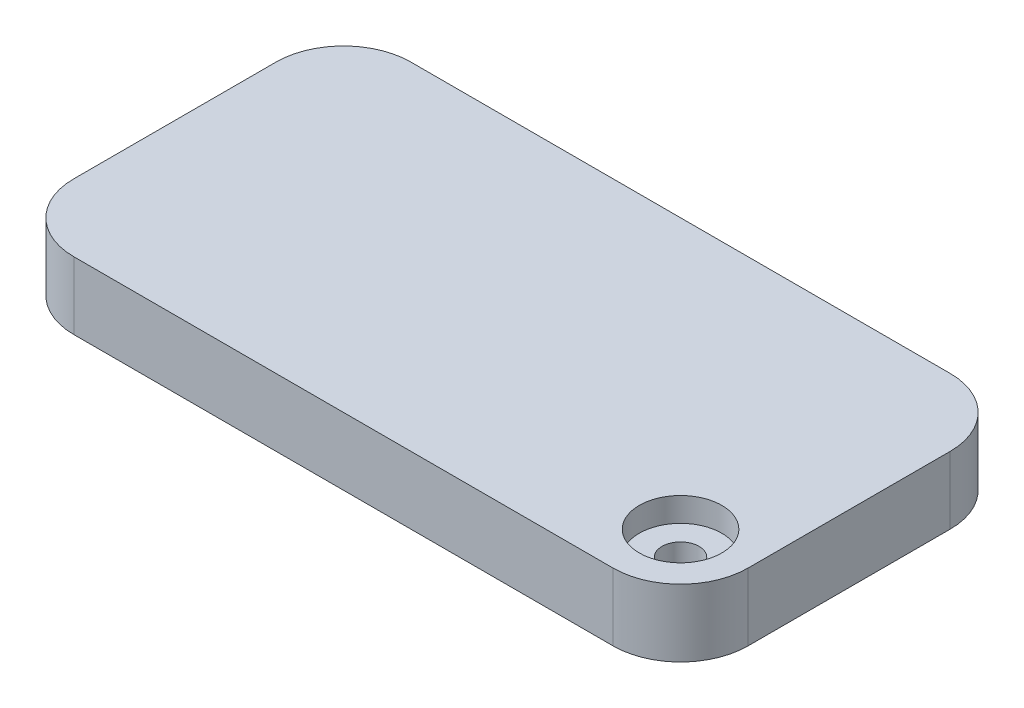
ISO-10303-21;
HEADER;
FILE_DESCRIPTION(('STEP AP214'),'2;1');
FILE_NAME('part.step','',(''),(''),'','','');
FILE_SCHEMA(('AUTOMOTIVE_DESIGN { 1 0 10303 214 1 1 1 1 }'));
ENDSEC;
DATA;
#1=APPLICATION_CONTEXT('core data for automotive mechanical design processes');
#2=APPLICATION_PROTOCOL_DEFINITION('international standard','automotive_design',2000,#1);
#3=PRODUCT_CONTEXT('',#1,'mechanical');
#4=PRODUCT('Part','Part','',(#3));
#5=PRODUCT_RELATED_PRODUCT_CATEGORY('part','',(#4));
#6=PRODUCT_DEFINITION_FORMATION('','',#4);
#7=PRODUCT_DEFINITION_CONTEXT('part definition',#1,'design');
#8=PRODUCT_DEFINITION('design','',#6,#7);
#9=PRODUCT_DEFINITION_SHAPE('','',#8);
#10=(LENGTH_UNIT() NAMED_UNIT(*) SI_UNIT(.MILLI.,.METRE.));
#11=(NAMED_UNIT(*) PLANE_ANGLE_UNIT() SI_UNIT($,.RADIAN.));
#12=(NAMED_UNIT(*) SI_UNIT($,.STERADIAN.) SOLID_ANGLE_UNIT());
#13=UNCERTAINTY_MEASURE_WITH_UNIT(LENGTH_MEASURE(1.E-05),#10,'distance_accuracy_value','');
#14=(GEOMETRIC_REPRESENTATION_CONTEXT(3) GLOBAL_UNCERTAINTY_ASSIGNED_CONTEXT((#13)) GLOBAL_UNIT_ASSIGNED_CONTEXT((#10,
#11,#12)) REPRESENTATION_CONTEXT('',''));
#15=CARTESIAN_POINT('',(0.,0.,0.));
#16=DIRECTION('',(0.,0.,1.));
#17=DIRECTION('',(1.,0.,0.));
#18=AXIS2_PLACEMENT_3D('',#15,#16,#17);
#19=CARTESIAN_POINT('',(10.,10.,-40.));
#20=DIRECTION('',(0.,-1.,0.));
#21=DIRECTION('',(0.,0.,-1.));
#22=AXIS2_PLACEMENT_3D('',#19,#20,#21);
#23=CYLINDRICAL_SURFACE('',#22,10.);
#24=CARTESIAN_POINT('',(10.,0.,-40.));
#25=DIRECTION('',(0.,1.,0.));
#26=DIRECTION('',(0.,0.,-1.));
#27=AXIS2_PLACEMENT_3D('',#24,#25,#26);
#28=CIRCLE('',#27,10.);
#29=CARTESIAN_POINT('',(10.,0.,-50.));
#30=VERTEX_POINT('',#29);
#31=CARTESIAN_POINT('',(0.,0.,-40.));
#32=VERTEX_POINT('',#31);
#33=EDGE_CURVE('E97',#30,#32,#28,.T.);
#34=ORIENTED_EDGE('',*,*,#33,.T.);
#35=DIRECTION('',(0.,-1.,0.));
#36=VECTOR('',#35,1.);
#37=CARTESIAN_POINT('',(0.,10.,-40.));
#38=LINE('',#37,#36);
#39=CARTESIAN_POINT('',(0.,10.,-40.));
#40=VERTEX_POINT('',#39);
#41=EDGE_CURVE('E11',#40,#32,#38,.T.);
#42=ORIENTED_EDGE('',*,*,#41,.F.);
#43=CARTESIAN_POINT('',(10.,10.,-40.));
#44=DIRECTION('',(0.,1.,0.));
#45=DIRECTION('',(0.,0.,-1.));
#46=AXIS2_PLACEMENT_3D('',#43,#44,#45);
#47=CIRCLE('',#46,10.);
#48=CARTESIAN_POINT('',(10.,10.,-50.));
#49=VERTEX_POINT('',#48);
#50=EDGE_CURVE('E129',#49,#40,#47,.T.);
#51=ORIENTED_EDGE('',*,*,#50,.F.);
#52=DIRECTION('',(0.,-1.,0.));
#53=VECTOR('',#52,1.);
#54=CARTESIAN_POINT('',(10.,10.,-50.));
#55=LINE('',#54,#53);
#56=EDGE_CURVE('E110',#49,#30,#55,.T.);
#57=ORIENTED_EDGE('',*,*,#56,.T.);
#58=EDGE_LOOP('',(#34,#42,#51,#57));
#59=FACE_BOUND('',#58,.T.);
#60=ADVANCED_FACE('F29',(#59),#23,.T.);
#61=CARTESIAN_POINT('',(0.,10.,-10.));
#62=DIRECTION('',(1.,0.,0.));
#63=DIRECTION('',(0.,0.,-1.));
#64=AXIS2_PLACEMENT_3D('',#61,#62,#63);
#65=PLANE('',#64);
#66=DIRECTION('',(0.,0.,1.));
#67=VECTOR('',#66,1.);
#68=CARTESIAN_POINT('',(0.,0.,-10.));
#69=LINE('',#68,#67);
#70=CARTESIAN_POINT('',(0.,0.,-10.));
#71=VERTEX_POINT('',#70);
#72=EDGE_CURVE('E93',#32,#71,#69,.T.);
#73=ORIENTED_EDGE('',*,*,#72,.T.);
#74=DIRECTION('',(0.,-1.,0.));
#75=VECTOR('',#74,1.);
#76=CARTESIAN_POINT('',(0.,10.,-10.));
#77=LINE('',#76,#75);
#78=CARTESIAN_POINT('',(0.,10.,-10.));
#79=VERTEX_POINT('',#78);
#80=EDGE_CURVE('E36',#79,#71,#77,.T.);
#81=ORIENTED_EDGE('',*,*,#80,.F.);
#82=DIRECTION('',(0.,0.,1.));
#83=VECTOR('',#82,1.);
#84=CARTESIAN_POINT('',(0.,10.,-10.));
#85=LINE('',#84,#83);
#86=EDGE_CURVE('E106',#40,#79,#85,.T.);
#87=ORIENTED_EDGE('',*,*,#86,.F.);
#88=ORIENTED_EDGE('',*,*,#41,.T.);
#89=EDGE_LOOP('',(#73,#81,#87,#88));
#90=FACE_BOUND('',#89,.T.);
#91=ADVANCED_FACE('F105',(#90),#65,.F.);
#92=CARTESIAN_POINT('',(10.,10.,-10.));
#93=DIRECTION('',(0.,-1.,0.));
#94=DIRECTION('',(0.,0.,-1.));
#95=AXIS2_PLACEMENT_3D('',#92,#93,#94);
#96=CYLINDRICAL_SURFACE('',#95,10.);
#97=CARTESIAN_POINT('',(10.,0.,-10.));
#98=DIRECTION('',(0.,1.,0.));
#99=DIRECTION('',(0.,0.,-1.));
#100=AXIS2_PLACEMENT_3D('',#97,#98,#99);
#101=CIRCLE('',#100,10.);
#102=CARTESIAN_POINT('',(10.,0.,0.));
#103=VERTEX_POINT('',#102);
#104=EDGE_CURVE('E99',#71,#103,#101,.T.);
#105=ORIENTED_EDGE('',*,*,#104,.T.);
#106=DIRECTION('',(0.,-1.,0.));
#107=VECTOR('',#106,1.);
#108=CARTESIAN_POINT('',(10.,10.,0.));
#109=LINE('',#108,#107);
#110=CARTESIAN_POINT('',(10.,10.,0.));
#111=VERTEX_POINT('',#110);
#112=EDGE_CURVE('E155',#111,#103,#109,.T.);
#113=ORIENTED_EDGE('',*,*,#112,.F.);
#114=CARTESIAN_POINT('',(10.,10.,-10.));
#115=DIRECTION('',(0.,1.,0.));
#116=DIRECTION('',(0.,0.,-1.));
#117=AXIS2_PLACEMENT_3D('',#114,#115,#116);
#118=CIRCLE('',#117,10.);
#119=EDGE_CURVE('E132',#79,#111,#118,.T.);
#120=ORIENTED_EDGE('',*,*,#119,.F.);
#121=ORIENTED_EDGE('',*,*,#80,.T.);
#122=EDGE_LOOP('',(#105,#113,#120,#121));
#123=FACE_BOUND('',#122,.T.);
#124=ADVANCED_FACE('F159',(#123),#96,.T.);
#125=CARTESIAN_POINT('',(10.,10.,0.));
#126=DIRECTION('',(0.,0.,-1.));
#127=DIRECTION('',(-1.,0.,0.));
#128=AXIS2_PLACEMENT_3D('',#125,#126,#127);
#129=PLANE('',#128);
#130=DIRECTION('',(1.,0.,0.));
#131=VECTOR('',#130,1.);
#132=CARTESIAN_POINT('',(10.,0.,0.));
#133=LINE('',#132,#131);
#134=CARTESIAN_POINT('',(90.,0.,0.));
#135=VERTEX_POINT('',#134);
#136=EDGE_CURVE('E119',#103,#135,#133,.T.);
#137=ORIENTED_EDGE('',*,*,#136,.T.);
#138=DIRECTION('',(0.,-1.,0.));
#139=VECTOR('',#138,1.);
#140=CARTESIAN_POINT('',(90.,10.,0.));
#141=LINE('',#140,#139);
#142=CARTESIAN_POINT('',(90.,10.,0.));
#143=VERTEX_POINT('',#142);
#144=EDGE_CURVE('E152',#143,#135,#141,.T.);
#145=ORIENTED_EDGE('',*,*,#144,.F.);
#146=DIRECTION('',(1.,0.,0.));
#147=VECTOR('',#146,1.);
#148=CARTESIAN_POINT('',(10.,10.,0.));
#149=LINE('',#148,#147);
#150=EDGE_CURVE('E134',#111,#143,#149,.T.);
#151=ORIENTED_EDGE('',*,*,#150,.F.);
#152=ORIENTED_EDGE('',*,*,#112,.T.);
#153=EDGE_LOOP('',(#137,#145,#151,#152));
#154=FACE_BOUND('',#153,.T.);
#155=ADVANCED_FACE('F167',(#154),#129,.F.);
#156=CARTESIAN_POINT('',(90.,10.,-10.));
#157=DIRECTION('',(0.,-1.,0.));
#158=DIRECTION('',(0.,0.,-1.));
#159=AXIS2_PLACEMENT_3D('',#156,#157,#158);
#160=CYLINDRICAL_SURFACE('',#159,10.);
#161=CARTESIAN_POINT('',(90.,0.,-10.));
#162=DIRECTION('',(0.,1.,0.));
#163=DIRECTION('',(0.,0.,1.));
#164=AXIS2_PLACEMENT_3D('',#161,#162,#163);
#165=CIRCLE('',#164,10.);
#166=CARTESIAN_POINT('',(100.,0.,-10.));
#167=VERTEX_POINT('',#166);
#168=EDGE_CURVE('E121',#135,#167,#165,.T.);
#169=ORIENTED_EDGE('',*,*,#168,.T.);
#170=DIRECTION('',(0.,-1.,0.));
#171=VECTOR('',#170,1.);
#172=CARTESIAN_POINT('',(100.,10.,-10.));
#173=LINE('',#172,#171);
#174=CARTESIAN_POINT('',(100.,10.,-10.));
#175=VERTEX_POINT('',#174);
#176=EDGE_CURVE('E149',#175,#167,#173,.T.);
#177=ORIENTED_EDGE('',*,*,#176,.F.);
#178=CARTESIAN_POINT('',(90.,10.,-10.));
#179=DIRECTION('',(0.,1.,0.));
#180=DIRECTION('',(0.,0.,1.));
#181=AXIS2_PLACEMENT_3D('',#178,#179,#180);
#182=CIRCLE('',#181,10.);
#183=EDGE_CURVE('E136',#143,#175,#182,.T.);
#184=ORIENTED_EDGE('',*,*,#183,.F.);
#185=ORIENTED_EDGE('',*,*,#144,.T.);
#186=EDGE_LOOP('',(#169,#177,#184,#185));
#187=FACE_BOUND('',#186,.T.);
#188=ADVANCED_FACE('F170',(#187),#160,.T.);
#189=CARTESIAN_POINT('',(100.,10.,-10.));
#190=DIRECTION('',(-1.,0.,0.));
#191=DIRECTION('',(0.,0.,1.));
#192=AXIS2_PLACEMENT_3D('',#189,#190,#191);
#193=PLANE('',#192);
#194=DIRECTION('',(0.,0.,-1.));
#195=VECTOR('',#194,1.);
#196=CARTESIAN_POINT('',(100.,0.,-10.));
#197=LINE('',#196,#195);
#198=CARTESIAN_POINT('',(100.,0.,-40.));
#199=VERTEX_POINT('',#198);
#200=EDGE_CURVE('E123',#167,#199,#197,.T.);
#201=ORIENTED_EDGE('',*,*,#200,.T.);
#202=DIRECTION('',(0.,-1.,0.));
#203=VECTOR('',#202,1.);
#204=CARTESIAN_POINT('',(100.,10.,-40.));
#205=LINE('',#204,#203);
#206=CARTESIAN_POINT('',(100.,10.,-40.));
#207=VERTEX_POINT('',#206);
#208=EDGE_CURVE('E146',#207,#199,#205,.T.);
#209=ORIENTED_EDGE('',*,*,#208,.F.);
#210=DIRECTION('',(0.,0.,-1.));
#211=VECTOR('',#210,1.);
#212=CARTESIAN_POINT('',(100.,10.,-10.));
#213=LINE('',#212,#211);
#214=EDGE_CURVE('E138',#175,#207,#213,.T.);
#215=ORIENTED_EDGE('',*,*,#214,.F.);
#216=ORIENTED_EDGE('',*,*,#176,.T.);
#217=EDGE_LOOP('',(#201,#209,#215,#216));
#218=FACE_BOUND('',#217,.T.);
#219=ADVANCED_FACE('F175',(#218),#193,.F.);
#220=CARTESIAN_POINT('',(90.,10.,-40.));
#221=DIRECTION('',(0.,-1.,0.));
#222=DIRECTION('',(0.,0.,-1.));
#223=AXIS2_PLACEMENT_3D('',#220,#221,#222);
#224=CYLINDRICAL_SURFACE('',#223,10.);
#225=CARTESIAN_POINT('',(90.,0.,-40.));
#226=DIRECTION('',(0.,1.,0.));
#227=DIRECTION('',(0.,0.,-1.));
#228=AXIS2_PLACEMENT_3D('',#225,#226,#227);
#229=CIRCLE('',#228,10.);
#230=CARTESIAN_POINT('',(90.,0.,-50.));
#231=VERTEX_POINT('',#230);
#232=EDGE_CURVE('E125',#199,#231,#229,.T.);
#233=ORIENTED_EDGE('',*,*,#232,.T.);
#234=DIRECTION('',(0.,-1.,0.));
#235=VECTOR('',#234,1.);
#236=CARTESIAN_POINT('',(90.,10.,-50.));
#237=LINE('',#236,#235);
#238=CARTESIAN_POINT('',(90.,10.,-50.));
#239=VERTEX_POINT('',#238);
#240=EDGE_CURVE('E143',#239,#231,#237,.T.);
#241=ORIENTED_EDGE('',*,*,#240,.F.);
#242=CARTESIAN_POINT('',(90.,10.,-40.));
#243=DIRECTION('',(0.,1.,0.));
#244=DIRECTION('',(0.,0.,-1.));
#245=AXIS2_PLACEMENT_3D('',#242,#243,#244);
#246=CIRCLE('',#245,10.);
#247=EDGE_CURVE('E48',#207,#239,#246,.T.);
#248=ORIENTED_EDGE('',*,*,#247,.F.);
#249=ORIENTED_EDGE('',*,*,#208,.T.);
#250=EDGE_LOOP('',(#233,#241,#248,#249));
#251=FACE_BOUND('',#250,.T.);
#252=ADVANCED_FACE('F178',(#251),#224,.T.);
#253=CARTESIAN_POINT('',(10.,10.,-50.));
#254=DIRECTION('',(0.,0.,1.));
#255=DIRECTION('',(1.,0.,0.));
#256=AXIS2_PLACEMENT_3D('',#253,#254,#255);
#257=PLANE('',#256);
#258=DIRECTION('',(-1.,0.,0.));
#259=VECTOR('',#258,1.);
#260=CARTESIAN_POINT('',(10.,0.,-50.));
#261=LINE('',#260,#259);
#262=EDGE_CURVE('E127',#231,#30,#261,.T.);
#263=ORIENTED_EDGE('',*,*,#262,.T.);
#264=ORIENTED_EDGE('',*,*,#56,.F.);
#265=DIRECTION('',(-1.,0.,0.));
#266=VECTOR('',#265,1.);
#267=CARTESIAN_POINT('',(10.,10.,-50.));
#268=LINE('',#267,#266);
#269=EDGE_CURVE('E43',#239,#49,#268,.T.);
#270=ORIENTED_EDGE('',*,*,#269,.F.);
#271=ORIENTED_EDGE('',*,*,#240,.T.);
#272=EDGE_LOOP('',(#263,#264,#270,#271));
#273=FACE_BOUND('',#272,.T.);
#274=ADVANCED_FACE('F180',(#273),#257,.F.);
#275=CARTESIAN_POINT('',(10.,10.,-40.));
#276=DIRECTION('',(0.,-1.,0.));
#277=DIRECTION('',(0.,0.,-1.));
#278=AXIS2_PLACEMENT_3D('',#275,#276,#277);
#279=PLANE('',#278);
#280=CARTESIAN_POINT('',(90.,10.,-10.));
#281=DIRECTION('',(0.,1.,0.));
#282=DIRECTION('',(0.,0.,1.));
#283=AXIS2_PLACEMENT_3D('',#280,#281,#282);
#284=CIRCLE('',#283,6.12);
#285=CARTESIAN_POINT('',(90.,10.,-3.88));
#286=VERTEX_POINT('',#285);
#287=EDGE_CURVE('E257',#286,#286,#284,.T.);
#288=ORIENTED_EDGE('',*,*,#287,.F.);
#289=EDGE_LOOP('',(#288));
#290=FACE_BOUND('',#289,.T.);
#291=ORIENTED_EDGE('',*,*,#50,.T.);
#292=ORIENTED_EDGE('',*,*,#86,.T.);
#293=ORIENTED_EDGE('',*,*,#119,.T.);
#294=ORIENTED_EDGE('',*,*,#150,.T.);
#295=ORIENTED_EDGE('',*,*,#183,.T.);
#296=ORIENTED_EDGE('',*,*,#214,.T.);
#297=ORIENTED_EDGE('',*,*,#247,.T.);
#298=ORIENTED_EDGE('',*,*,#269,.T.);
#299=EDGE_LOOP('',(#291,#292,#293,#294,#295,#296,#297,#298));
#300=FACE_BOUND('',#299,.T.);
#301=ADVANCED_FACE('F162',(#290,#300),#279,.F.);
#302=CARTESIAN_POINT('',(10.,0.,-40.));
#303=DIRECTION('',(0.,-1.,0.));
#304=DIRECTION('',(0.,0.,-1.));
#305=AXIS2_PLACEMENT_3D('',#302,#303,#304);
#306=PLANE('',#305);
#307=CARTESIAN_POINT('',(90.,0.,-10.));
#308=DIRECTION('',(0.,1.,0.));
#309=DIRECTION('',(0.,0.,1.));
#310=AXIS2_PLACEMENT_3D('',#307,#308,#309);
#311=CIRCLE('',#310,2.75);
#312=CARTESIAN_POINT('',(90.,0.,-7.25));
#313=VERTEX_POINT('',#312);
#314=EDGE_CURVE('E111',#313,#313,#311,.T.);
#315=ORIENTED_EDGE('',*,*,#314,.T.);
#316=EDGE_LOOP('',(#315));
#317=FACE_BOUND('',#316,.T.);
#318=ORIENTED_EDGE('',*,*,#33,.F.);
#319=ORIENTED_EDGE('',*,*,#262,.F.);
#320=ORIENTED_EDGE('',*,*,#232,.F.);
#321=ORIENTED_EDGE('',*,*,#200,.F.);
#322=ORIENTED_EDGE('',*,*,#168,.F.);
#323=ORIENTED_EDGE('',*,*,#136,.F.);
#324=ORIENTED_EDGE('',*,*,#104,.F.);
#325=ORIENTED_EDGE('',*,*,#72,.F.);
#326=EDGE_LOOP('',(#318,#319,#320,#321,#322,#323,#324,#325));
#327=FACE_BOUND('',#326,.T.);
#328=ADVANCED_FACE('F94',(#317,#327),#306,.T.);
#329=CARTESIAN_POINT('',(90.,10.,-10.));
#330=DIRECTION('',(0.,1.,0.));
#331=DIRECTION('',(0.,0.,1.));
#332=AXIS2_PLACEMENT_3D('',#329,#330,#331);
#333=CYLINDRICAL_SURFACE('',#332,2.75);
#334=ORIENTED_EDGE('',*,*,#314,.F.);
#335=EDGE_LOOP('',(#334));
#336=FACE_BOUND('',#335,.T.);
#337=CARTESIAN_POINT('',(90.,6.42,-10.));
#338=DIRECTION('',(0.,1.,0.));
#339=DIRECTION('',(0.,0.,1.));
#340=AXIS2_PLACEMENT_3D('',#337,#338,#339);
#341=CIRCLE('',#340,2.75);
#342=CARTESIAN_POINT('',(90.,6.42,-7.25));
#343=VERTEX_POINT('',#342);
#344=EDGE_CURVE('E114',#343,#343,#341,.T.);
#345=ORIENTED_EDGE('',*,*,#344,.T.);
#346=EDGE_LOOP('',(#345));
#347=FACE_BOUND('',#346,.T.);
#348=ADVANCED_FACE('F225',(#336,#347),#333,.F.);
#349=CARTESIAN_POINT('',(92.75,6.42,-10.));
#350=DIRECTION('',(0.,-1.,0.));
#351=DIRECTION('',(0.,0.,-1.));
#352=AXIS2_PLACEMENT_3D('',#349,#350,#351);
#353=PLANE('',#352);
#354=ORIENTED_EDGE('',*,*,#344,.F.);
#355=EDGE_LOOP('',(#354));
#356=FACE_BOUND('',#355,.T.);
#357=CARTESIAN_POINT('',(90.,6.42,-10.));
#358=DIRECTION('',(0.,1.,0.));
#359=DIRECTION('',(0.,0.,1.));
#360=AXIS2_PLACEMENT_3D('',#357,#358,#359);
#361=CIRCLE('',#360,6.12);
#362=CARTESIAN_POINT('',(90.,6.42,-3.88));
#363=VERTEX_POINT('',#362);
#364=EDGE_CURVE('E254',#363,#363,#361,.T.);
#365=ORIENTED_EDGE('',*,*,#364,.T.);
#366=EDGE_LOOP('',(#365));
#367=FACE_BOUND('',#366,.T.);
#368=ADVANCED_FACE('F233',(#356,#367),#353,.F.);
#369=CARTESIAN_POINT('',(90.,10.,-10.));
#370=DIRECTION('',(0.,1.,0.));
#371=DIRECTION('',(0.,0.,1.));
#372=AXIS2_PLACEMENT_3D('',#369,#370,#371);
#373=CYLINDRICAL_SURFACE('',#372,6.12);
#374=ORIENTED_EDGE('',*,*,#364,.F.);
#375=EDGE_LOOP('',(#374));
#376=FACE_BOUND('',#375,.T.);
#377=ORIENTED_EDGE('',*,*,#287,.T.);
#378=EDGE_LOOP('',(#377));
#379=FACE_BOUND('',#378,.T.);
#380=ADVANCED_FACE('F241',(#376,#379),#373,.F.);
#381=CLOSED_SHELL('',(#60,#91,#124,#155,#188,#219,#252,#274,#301,#328,#348,#368,#380));
#382=MANIFOLD_SOLID_BREP('B2',#381);
#383=ADVANCED_BREP_SHAPE_REPRESENTATION('',(#18,#382),#14);
#384=SHAPE_DEFINITION_REPRESENTATION(#9,#383);
ENDSEC;
END-ISO-10303-21;
